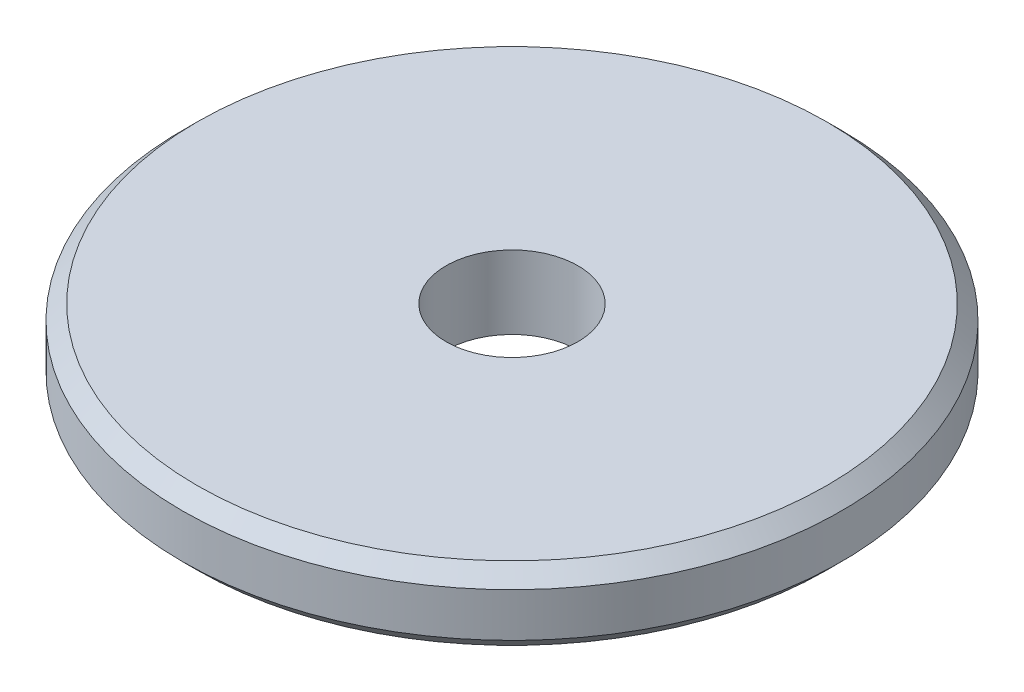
from build123d import *

# Parameters (mm, degrees)
SKETCH1_R      = 22.5
SKETCH1_R_2    = 4.5
EXTRUDE1_DEPTH = 5
CHAMFER1_SIZE  = 1


with BuildPart() as part:
    # Sketch1 → Extrude1 (new body)
    with BuildSketch(Plane(origin=(0, 0, 0), x_dir=(1, 0, 0), z_dir=(0, 1, 0))):
        with Locations(Location((0, 0, 0), (0, 0, 270))):
            Circle(SKETCH1_R)
        with Locations(Location((0, 0, 0), (0, 0, 270))):
            Circle(SKETCH1_R_2, mode=Mode.SUBTRACT)
    extrude(amount=EXTRUDE1_DEPTH)

    # Chamfer1
    chamfer1_edges = [part.edges().sort_by_distance(p)[0] for p in [
        (0, 0, -22.5),
        (0, 5, -22.5),
    ]]
    chamfer(chamfer1_edges, length=CHAMFER1_SIZE)


solid = part.part
